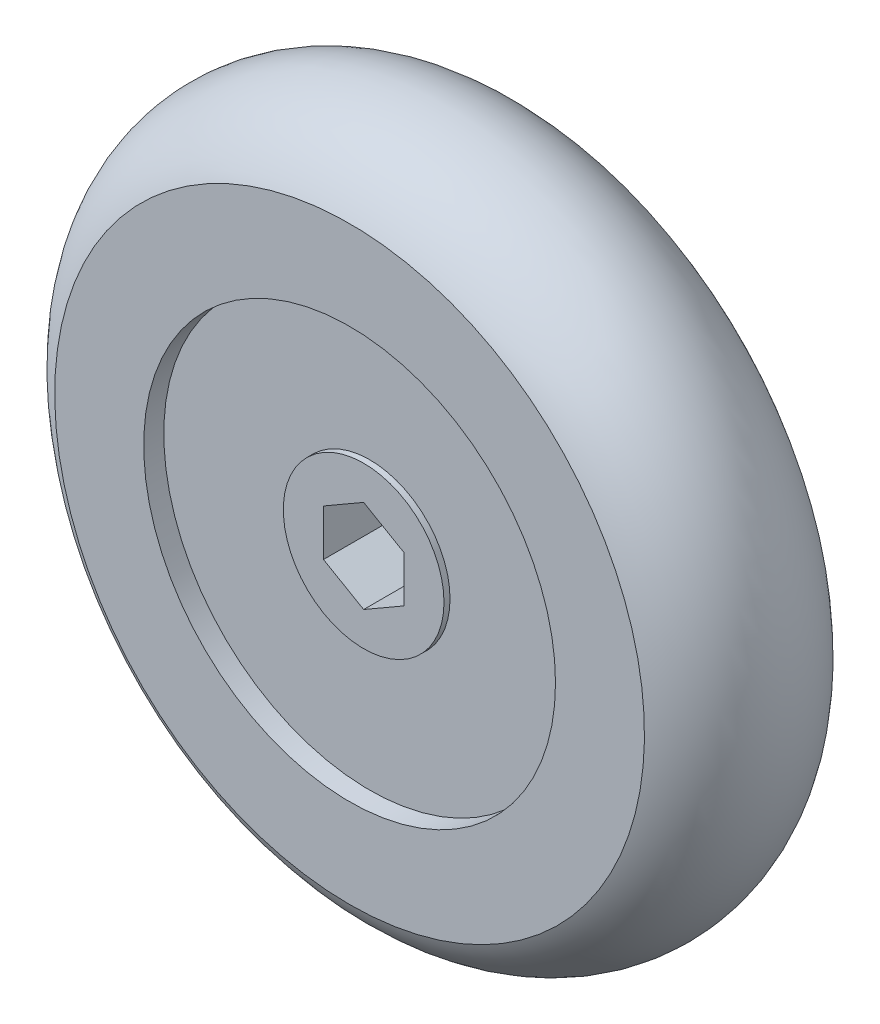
ISO-10303-21;
HEADER;
FILE_DESCRIPTION(('STEP AP214'),'2;1');
FILE_NAME('part.step','',(''),(''),'','','');
FILE_SCHEMA(('AUTOMOTIVE_DESIGN { 1 0 10303 214 1 1 1 1 }'));
ENDSEC;
DATA;
#1=APPLICATION_CONTEXT('core data for automotive mechanical design processes');
#2=APPLICATION_PROTOCOL_DEFINITION('international standard','automotive_design',2000,#1);
#3=PRODUCT_CONTEXT('',#1,'mechanical');
#4=PRODUCT('Part','Part','',(#3));
#5=PRODUCT_RELATED_PRODUCT_CATEGORY('part','',(#4));
#6=PRODUCT_DEFINITION_FORMATION('','',#4);
#7=PRODUCT_DEFINITION_CONTEXT('part definition',#1,'design');
#8=PRODUCT_DEFINITION('design','',#6,#7);
#9=PRODUCT_DEFINITION_SHAPE('','',#8);
#10=(LENGTH_UNIT() NAMED_UNIT(*) SI_UNIT(.MILLI.,.METRE.));
#11=(NAMED_UNIT(*) PLANE_ANGLE_UNIT() SI_UNIT($,.RADIAN.));
#12=(NAMED_UNIT(*) SI_UNIT($,.STERADIAN.) SOLID_ANGLE_UNIT());
#13=UNCERTAINTY_MEASURE_WITH_UNIT(LENGTH_MEASURE(1.E-05),#10,'distance_accuracy_value','');
#14=(GEOMETRIC_REPRESENTATION_CONTEXT(3) GLOBAL_UNCERTAINTY_ASSIGNED_CONTEXT((#13)) GLOBAL_UNIT_ASSIGNED_CONTEXT((#10,
#11,#12)) REPRESENTATION_CONTEXT('',''));
#15=CARTESIAN_POINT('',(0.,0.,0.));
#16=DIRECTION('',(0.,0.,1.));
#17=DIRECTION('',(1.,0.,0.));
#18=AXIS2_PLACEMENT_3D('',#15,#16,#17);
#19=CARTESIAN_POINT('',(0.,14.679449,9.5));
#20=DIRECTION('',(0.,0.,1.));
#21=DIRECTION('',(1.,0.,0.));
#22=AXIS2_PLACEMENT_3D('',#19,#20,#21);
#23=PLANE('',#22);
#24=CARTESIAN_POINT('',(0.,0.,9.5));
#25=DIRECTION('',(0.,0.,1.));
#26=DIRECTION('',(0.,-1.,0.));
#27=AXIS2_PLACEMENT_3D('',#24,#25,#26);
#28=CIRCLE('',#27,14.6794494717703);
#29=CARTESIAN_POINT('',(0.,-14.6794494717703,9.50000000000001));
#30=VERTEX_POINT('',#29);
#31=EDGE_CURVE('E231',#30,#30,#28,.T.);
#32=ORIENTED_EDGE('',*,*,#31,.T.);
#33=EDGE_LOOP('',(#32));
#34=FACE_BOUND('',#33,.T.);
#35=CARTESIAN_POINT('',(0.,0.,9.5));
#36=DIRECTION('',(0.,0.,1.));
#37=DIRECTION('',(1.,0.,0.));
#38=AXIS2_PLACEMENT_3D('',#35,#36,#37);
#39=CIRCLE('',#38,10.25);
#40=CARTESIAN_POINT('',(10.25,0.,9.5));
#41=VERTEX_POINT('',#40);
#42=EDGE_CURVE('E9',#41,#41,#39,.T.);
#43=ORIENTED_EDGE('',*,*,#42,.F.);
#44=EDGE_LOOP('',(#43));
#45=FACE_BOUND('',#44,.T.);
#46=ADVANCED_FACE('F14',(#34,#45),#23,.T.);
#47=CARTESIAN_POINT('',(0.,0.,12.5));
#48=DIRECTION('',(0.,0.,1.));
#49=DIRECTION('',(1.,0.,0.));
#50=AXIS2_PLACEMENT_3D('',#47,#48,#49);
#51=CYLINDRICAL_SURFACE('',#50,10.25);
#52=ORIENTED_EDGE('',*,*,#42,.T.);
#53=EDGE_LOOP('',(#52));
#54=FACE_BOUND('',#53,.T.);
#55=CARTESIAN_POINT('',(0.,0.,8.5));
#56=DIRECTION('',(0.,0.,1.));
#57=DIRECTION('',(1.,0.,0.));
#58=AXIS2_PLACEMENT_3D('',#55,#56,#57);
#59=CIRCLE('',#58,10.25);
#60=CARTESIAN_POINT('',(10.25,0.,8.5));
#61=VERTEX_POINT('',#60);
#62=EDGE_CURVE('E21',#61,#61,#59,.T.);
#63=ORIENTED_EDGE('',*,*,#62,.F.);
#64=EDGE_LOOP('',(#63));
#65=FACE_BOUND('',#64,.T.);
#66=ADVANCED_FACE('F119',(#54,#65),#51,.F.);
#67=CARTESIAN_POINT('',(0.,10.25,8.5));
#68=DIRECTION('',(0.,0.,1.));
#69=DIRECTION('',(1.,0.,0.));
#70=AXIS2_PLACEMENT_3D('',#67,#68,#69);
#71=PLANE('',#70);
#72=ORIENTED_EDGE('',*,*,#62,.T.);
#73=EDGE_LOOP('',(#72));
#74=FACE_BOUND('',#73,.T.);
#75=CARTESIAN_POINT('',(0.,0.,8.49999999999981));
#76=DIRECTION('',(0.,0.,1.));
#77=DIRECTION('',(1.,0.,0.));
#78=AXIS2_PLACEMENT_3D('',#75,#76,#77);
#79=CIRCLE('',#78,4.0000000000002);
#80=CARTESIAN_POINT('',(4.0000000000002,0.,8.49999999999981));
#81=VERTEX_POINT('',#80);
#82=EDGE_CURVE('E111',#81,#81,#79,.T.);
#83=ORIENTED_EDGE('',*,*,#82,.F.);
#84=EDGE_LOOP('',(#83));
#85=FACE_BOUND('',#84,.T.);
#86=ADVANCED_FACE('F116',(#74,#85),#71,.T.);
#87=CARTESIAN_POINT('',(0.,0.,12.5));
#88=DIRECTION('',(0.,0.,1.));
#89=DIRECTION('',(1.,0.,0.));
#90=AXIS2_PLACEMENT_3D('',#87,#88,#89);
#91=CYLINDRICAL_SURFACE('',#90,4.0000000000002);
#92=ORIENTED_EDGE('',*,*,#82,.T.);
#93=EDGE_LOOP('',(#92));
#94=FACE_BOUND('',#93,.T.);
#95=CARTESIAN_POINT('',(0.,0.,8.8));
#96=DIRECTION('',(0.,0.,1.));
#97=DIRECTION('',(1.,0.,0.));
#98=AXIS2_PLACEMENT_3D('',#95,#96,#97);
#99=CIRCLE('',#98,4.0000000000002);
#100=CARTESIAN_POINT('',(4.0000000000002,0.,8.8));
#101=VERTEX_POINT('',#100);
#102=EDGE_CURVE('E108',#101,#101,#99,.T.);
#103=ORIENTED_EDGE('',*,*,#102,.F.);
#104=EDGE_LOOP('',(#103));
#105=FACE_BOUND('',#104,.T.);
#106=ADVANCED_FACE('F127',(#94,#105),#91,.T.);
#107=CARTESIAN_POINT('',(0.,4.0000000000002,8.8));
#108=DIRECTION('',(0.,0.,1.));
#109=DIRECTION('',(1.,0.,0.));
#110=AXIS2_PLACEMENT_3D('',#107,#108,#109);
#111=PLANE('',#110);
#112=ORIENTED_EDGE('',*,*,#102,.T.);
#113=EDGE_LOOP('',(#112));
#114=FACE_BOUND('',#113,.T.);
#115=DIRECTION('',(0.866025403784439,-0.5,0.));
#116=VECTOR('',#115,1.);
#117=CARTESIAN_POINT('',(-2.,-1.15470053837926,8.8));
#118=LINE('',#117,#116);
#119=CARTESIAN_POINT('',(-2.,-1.15470053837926,8.8));
#120=VERTEX_POINT('',#119);
#121=CARTESIAN_POINT('',(0.,-2.30940107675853,8.8));
#122=VERTEX_POINT('',#121);
#123=EDGE_CURVE('E70',#120,#122,#118,.T.);
#124=ORIENTED_EDGE('',*,*,#123,.F.);
#125=DIRECTION('',(0.,-1.,0.));
#126=VECTOR('',#125,1.);
#127=CARTESIAN_POINT('',(-2.,1.15470053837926,8.8));
#128=LINE('',#127,#126);
#129=CARTESIAN_POINT('',(-2.,1.15470053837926,8.8));
#130=VERTEX_POINT('',#129);
#131=EDGE_CURVE('E64',#130,#120,#128,.T.);
#132=ORIENTED_EDGE('',*,*,#131,.F.);
#133=DIRECTION('',(-0.866025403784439,-0.5,0.));
#134=VECTOR('',#133,1.);
#135=CARTESIAN_POINT('',(0.,2.30940107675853,8.8));
#136=LINE('',#135,#134);
#137=CARTESIAN_POINT('',(0.,2.30940107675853,8.8));
#138=VERTEX_POINT('',#137);
#139=EDGE_CURVE('E67',#138,#130,#136,.T.);
#140=ORIENTED_EDGE('',*,*,#139,.F.);
#141=DIRECTION('',(-0.866025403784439,0.5,0.));
#142=VECTOR('',#141,1.);
#143=CARTESIAN_POINT('',(2.,1.15470053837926,8.8));
#144=LINE('',#143,#142);
#145=CARTESIAN_POINT('',(2.,1.15470053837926,8.8));
#146=VERTEX_POINT('',#145);
#147=EDGE_CURVE('E84',#146,#138,#144,.T.);
#148=ORIENTED_EDGE('',*,*,#147,.F.);
#149=DIRECTION('',(0.,1.,0.));
#150=VECTOR('',#149,1.);
#151=CARTESIAN_POINT('',(2.,-1.15470053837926,8.8));
#152=LINE('',#151,#150);
#153=CARTESIAN_POINT('',(2.,-1.15470053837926,8.8));
#154=VERTEX_POINT('',#153);
#155=EDGE_CURVE('E237',#154,#146,#152,.T.);
#156=ORIENTED_EDGE('',*,*,#155,.F.);
#157=DIRECTION('',(0.866025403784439,0.5,0.));
#158=VECTOR('',#157,1.);
#159=CARTESIAN_POINT('',(0.,-2.30940107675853,8.8));
#160=LINE('',#159,#158);
#161=EDGE_CURVE('E240',#122,#154,#160,.T.);
#162=ORIENTED_EDGE('',*,*,#161,.F.);
#163=EDGE_LOOP('',(#124,#132,#140,#148,#156,#162));
#164=FACE_BOUND('',#163,.T.);
#165=ADVANCED_FACE('F66',(#114,#164),#111,.T.);
#166=CARTESIAN_POINT('',(-2.,1.15470053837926,16.4376261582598));
#167=DIRECTION('',(1.,0.,0.));
#168=DIRECTION('',(0.,0.,-1.));
#169=AXIS2_PLACEMENT_3D('',#166,#167,#168);
#170=PLANE('',#169);
#171=DIRECTION('',(0.,0.,-1.));
#172=VECTOR('',#171,1.);
#173=CARTESIAN_POINT('',(-2.,1.15470053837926,16.4376261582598));
#174=LINE('',#173,#172);
#175=CARTESIAN_POINT('',(-2.,1.15470053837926,5.3));
#176=VERTEX_POINT('',#175);
#177=EDGE_CURVE('E80',#130,#176,#174,.T.);
#178=ORIENTED_EDGE('',*,*,#177,.F.);
#179=ORIENTED_EDGE('',*,*,#131,.T.);
#180=DIRECTION('',(0.,0.,-1.));
#181=VECTOR('',#180,1.);
#182=CARTESIAN_POINT('',(-2.,-1.15470053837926,16.4376261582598));
#183=LINE('',#182,#181);
#184=CARTESIAN_POINT('',(-2.,-1.15470053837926,5.3));
#185=VERTEX_POINT('',#184);
#186=EDGE_CURVE('E89',#120,#185,#183,.T.);
#187=ORIENTED_EDGE('',*,*,#186,.T.);
#188=DIRECTION('',(0.,-1.,0.));
#189=VECTOR('',#188,1.);
#190=CARTESIAN_POINT('',(-2.,1.15470053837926,5.3));
#191=LINE('',#190,#189);
#192=EDGE_CURVE('E88',#176,#185,#191,.T.);
#193=ORIENTED_EDGE('',*,*,#192,.F.);
#194=EDGE_LOOP('',(#178,#179,#187,#193));
#195=FACE_BOUND('',#194,.T.);
#196=ADVANCED_FACE('F87',(#195),#170,.T.);
#197=CARTESIAN_POINT('',(0.,2.30940107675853,16.4376261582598));
#198=DIRECTION('',(0.5,-0.866025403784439,0.));
#199=DIRECTION('',(0.866025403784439,0.5,0.));
#200=AXIS2_PLACEMENT_3D('',#197,#198,#199);
#201=PLANE('',#200);
#202=DIRECTION('',(0.,0.,-1.));
#203=VECTOR('',#202,1.);
#204=CARTESIAN_POINT('',(0.,2.30940107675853,16.4376261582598));
#205=LINE('',#204,#203);
#206=CARTESIAN_POINT('',(0.,2.30940107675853,5.3));
#207=VERTEX_POINT('',#206);
#208=EDGE_CURVE('E82',#138,#207,#205,.T.);
#209=ORIENTED_EDGE('',*,*,#208,.F.);
#210=ORIENTED_EDGE('',*,*,#139,.T.);
#211=ORIENTED_EDGE('',*,*,#177,.T.);
#212=DIRECTION('',(-0.866025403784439,-0.5,0.));
#213=VECTOR('',#212,1.);
#214=CARTESIAN_POINT('',(0.,2.30940107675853,5.3));
#215=LINE('',#214,#213);
#216=EDGE_CURVE('E28',#207,#176,#215,.T.);
#217=ORIENTED_EDGE('',*,*,#216,.F.);
#218=EDGE_LOOP('',(#209,#210,#211,#217));
#219=FACE_BOUND('',#218,.T.);
#220=ADVANCED_FACE('F79',(#219),#201,.T.);
#221=CARTESIAN_POINT('',(2.,1.15470053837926,16.4376261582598));
#222=DIRECTION('',(-0.5,-0.866025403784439,0.));
#223=DIRECTION('',(0.866025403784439,-0.5,0.));
#224=AXIS2_PLACEMENT_3D('',#221,#222,#223);
#225=PLANE('',#224);
#226=DIRECTION('',(0.,0.,-1.));
#227=VECTOR('',#226,1.);
#228=CARTESIAN_POINT('',(2.,1.15470053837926,16.4376261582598));
#229=LINE('',#228,#227);
#230=CARTESIAN_POINT('',(2.,1.15470053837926,5.3));
#231=VERTEX_POINT('',#230);
#232=EDGE_CURVE('E91',#146,#231,#229,.T.);
#233=ORIENTED_EDGE('',*,*,#232,.F.);
#234=ORIENTED_EDGE('',*,*,#147,.T.);
#235=ORIENTED_EDGE('',*,*,#208,.T.);
#236=DIRECTION('',(-0.866025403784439,0.5,0.));
#237=VECTOR('',#236,1.);
#238=CARTESIAN_POINT('',(2.,1.15470053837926,5.3));
#239=LINE('',#238,#237);
#240=EDGE_CURVE('E33',#231,#207,#239,.T.);
#241=ORIENTED_EDGE('',*,*,#240,.F.);
#242=EDGE_LOOP('',(#233,#234,#235,#241));
#243=FACE_BOUND('',#242,.T.);
#244=ADVANCED_FACE('F165',(#243),#225,.T.);
#245=CARTESIAN_POINT('',(2.,-1.15470053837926,16.4376261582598));
#246=DIRECTION('',(-1.,0.,0.));
#247=DIRECTION('',(0.,0.,1.));
#248=AXIS2_PLACEMENT_3D('',#245,#246,#247);
#249=PLANE('',#248);
#250=DIRECTION('',(0.,0.,-1.));
#251=VECTOR('',#250,1.);
#252=CARTESIAN_POINT('',(2.,-1.15470053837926,16.4376261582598));
#253=LINE('',#252,#251);
#254=CARTESIAN_POINT('',(2.,-1.15470053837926,5.3));
#255=VERTEX_POINT('',#254);
#256=EDGE_CURVE('E98',#154,#255,#253,.T.);
#257=ORIENTED_EDGE('',*,*,#256,.F.);
#258=ORIENTED_EDGE('',*,*,#155,.T.);
#259=ORIENTED_EDGE('',*,*,#232,.T.);
#260=DIRECTION('',(0.,1.,0.));
#261=VECTOR('',#260,1.);
#262=CARTESIAN_POINT('',(2.,-1.15470053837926,5.3));
#263=LINE('',#262,#261);
#264=EDGE_CURVE('E248',#255,#231,#263,.T.);
#265=ORIENTED_EDGE('',*,*,#264,.F.);
#266=EDGE_LOOP('',(#257,#258,#259,#265));
#267=FACE_BOUND('',#266,.T.);
#268=ADVANCED_FACE('F161',(#267),#249,.T.);
#269=CARTESIAN_POINT('',(0.,-2.30940107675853,16.4376261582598));
#270=DIRECTION('',(-0.5,0.866025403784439,0.));
#271=DIRECTION('',(-0.866025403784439,-0.5,0.));
#272=AXIS2_PLACEMENT_3D('',#269,#270,#271);
#273=PLANE('',#272);
#274=DIRECTION('',(0.,0.,-1.));
#275=VECTOR('',#274,1.);
#276=CARTESIAN_POINT('',(0.,-2.30940107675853,16.4376261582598));
#277=LINE('',#276,#275);
#278=CARTESIAN_POINT('',(0.,-2.30940107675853,5.3));
#279=VERTEX_POINT('',#278);
#280=EDGE_CURVE('E76',#122,#279,#277,.T.);
#281=ORIENTED_EDGE('',*,*,#280,.F.);
#282=ORIENTED_EDGE('',*,*,#161,.T.);
#283=ORIENTED_EDGE('',*,*,#256,.T.);
#284=DIRECTION('',(0.866025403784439,0.5,0.));
#285=VECTOR('',#284,1.);
#286=CARTESIAN_POINT('',(0.,-2.30940107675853,5.3));
#287=LINE('',#286,#285);
#288=EDGE_CURVE('E246',#279,#255,#287,.T.);
#289=ORIENTED_EDGE('',*,*,#288,.F.);
#290=EDGE_LOOP('',(#281,#282,#283,#289));
#291=FACE_BOUND('',#290,.T.);
#292=ADVANCED_FACE('F157',(#291),#273,.T.);
#293=CARTESIAN_POINT('',(-2.,-1.15470053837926,16.4376261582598));
#294=DIRECTION('',(0.5,0.866025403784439,0.));
#295=DIRECTION('',(-0.866025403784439,0.5,0.));
#296=AXIS2_PLACEMENT_3D('',#293,#294,#295);
#297=PLANE('',#296);
#298=ORIENTED_EDGE('',*,*,#186,.F.);
#299=ORIENTED_EDGE('',*,*,#123,.T.);
#300=ORIENTED_EDGE('',*,*,#280,.T.);
#301=DIRECTION('',(0.866025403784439,-0.5,0.));
#302=VECTOR('',#301,1.);
#303=CARTESIAN_POINT('',(-2.,-1.15470053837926,5.3));
#304=LINE('',#303,#302);
#305=EDGE_CURVE('E244',#185,#279,#304,.T.);
#306=ORIENTED_EDGE('',*,*,#305,.F.);
#307=EDGE_LOOP('',(#298,#299,#300,#306));
#308=FACE_BOUND('',#307,.T.);
#309=ADVANCED_FACE('F154',(#308),#297,.T.);
#310=CARTESIAN_POINT('',(0.,0.,5.3));
#311=DIRECTION('',(0.,0.,1.));
#312=DIRECTION('',(1.,0.,0.));
#313=AXIS2_PLACEMENT_3D('',#310,#311,#312);
#314=PLANE('',#313);
#315=ORIENTED_EDGE('',*,*,#192,.T.);
#316=ORIENTED_EDGE('',*,*,#305,.T.);
#317=ORIENTED_EDGE('',*,*,#288,.T.);
#318=ORIENTED_EDGE('',*,*,#264,.T.);
#319=ORIENTED_EDGE('',*,*,#240,.T.);
#320=ORIENTED_EDGE('',*,*,#216,.T.);
#321=EDGE_LOOP('',(#315,#316,#317,#318,#319,#320));
#322=FACE_BOUND('',#321,.T.);
#323=ADVANCED_FACE('F151',(#322),#314,.T.);
#324=CARTESIAN_POINT('',(0.,0.,5.));
#325=DIRECTION('',(0.,0.,1.));
#326=DIRECTION('',(0.,-1.,0.));
#327=AXIS2_PLACEMENT_3D('',#324,#325,#326);
#328=TOROIDAL_SURFACE('',#327,12.5,5.);
#329=ORIENTED_EDGE('',*,*,#31,.F.);
#330=EDGE_LOOP('',(#329));
#331=FACE_BOUND('',#330,.T.);
#332=CARTESIAN_POINT('',(0.,0.,0.500000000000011));
#333=DIRECTION('',(0.,0.,1.));
#334=DIRECTION('',(0.,-1.,0.));
#335=AXIS2_PLACEMENT_3D('',#332,#333,#334);
#336=CIRCLE('',#335,14.6794494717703);
#337=CARTESIAN_POINT('',(0.,-14.6794494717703,0.500000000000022));
#338=VERTEX_POINT('',#337);
#339=EDGE_CURVE('E85',#338,#338,#336,.T.);
#340=ORIENTED_EDGE('',*,*,#339,.T.);
#341=EDGE_LOOP('',(#340));
#342=FACE_BOUND('',#341,.T.);
#343=ADVANCED_FACE('F141',(#331,#342),#328,.T.);
#344=CARTESIAN_POINT('',(0.,5.1,1.5));
#345=DIRECTION('',(0.,0.,-1.));
#346=DIRECTION('',(-1.,0.,0.));
#347=AXIS2_PLACEMENT_3D('',#344,#345,#346);
#348=PLANE('',#347);
#349=CARTESIAN_POINT('',(0.,0.,1.5));
#350=DIRECTION('',(0.,0.,1.));
#351=DIRECTION('',(1.,0.,0.));
#352=AXIS2_PLACEMENT_3D('',#349,#350,#351);
#353=CIRCLE('',#352,10.25);
#354=CARTESIAN_POINT('',(10.25,0.,1.5));
#355=VERTEX_POINT('',#354);
#356=EDGE_CURVE('E105',#355,#355,#353,.T.);
#357=ORIENTED_EDGE('',*,*,#356,.F.);
#358=EDGE_LOOP('',(#357));
#359=FACE_BOUND('',#358,.T.);
#360=CARTESIAN_POINT('',(0.,0.,1.5));
#361=DIRECTION('',(0.,0.,-1.));
#362=DIRECTION('',(-1.,0.,0.));
#363=AXIS2_PLACEMENT_3D('',#360,#361,#362);
#364=CIRCLE('',#363,5.);
#365=CARTESIAN_POINT('',(-5.,0.,1.5));
#366=VERTEX_POINT('',#365);
#367=EDGE_CURVE('E208',#366,#366,#364,.F.);
#368=ORIENTED_EDGE('',*,*,#367,.T.);
#369=EDGE_LOOP('',(#368));
#370=FACE_BOUND('',#369,.T.);
#371=ADVANCED_FACE('F137',(#359,#370),#348,.T.);
#372=CARTESIAN_POINT('',(0.,0.,12.5));
#373=DIRECTION('',(0.,0.,1.));
#374=DIRECTION('',(1.,0.,0.));
#375=AXIS2_PLACEMENT_3D('',#372,#373,#374);
#376=CYLINDRICAL_SURFACE('',#375,10.25);
#377=ORIENTED_EDGE('',*,*,#356,.T.);
#378=EDGE_LOOP('',(#377));
#379=FACE_BOUND('',#378,.T.);
#380=CARTESIAN_POINT('',(0.,0.,0.5));
#381=DIRECTION('',(0.,0.,1.));
#382=DIRECTION('',(1.,0.,0.));
#383=AXIS2_PLACEMENT_3D('',#380,#381,#382);
#384=CIRCLE('',#383,10.25);
#385=CARTESIAN_POINT('',(10.25,0.,0.5));
#386=VERTEX_POINT('',#385);
#387=EDGE_CURVE('E75',#386,#386,#384,.T.);
#388=ORIENTED_EDGE('',*,*,#387,.F.);
#389=EDGE_LOOP('',(#388));
#390=FACE_BOUND('',#389,.T.);
#391=ADVANCED_FACE('F140',(#379,#390),#376,.F.);
#392=CARTESIAN_POINT('',(0.,14.679449,0.5));
#393=DIRECTION('',(0.,0.,-1.));
#394=DIRECTION('',(-1.,0.,0.));
#395=AXIS2_PLACEMENT_3D('',#392,#393,#394);
#396=PLANE('',#395);
#397=ORIENTED_EDGE('',*,*,#387,.T.);
#398=EDGE_LOOP('',(#397));
#399=FACE_BOUND('',#398,.T.);
#400=ORIENTED_EDGE('',*,*,#339,.F.);
#401=EDGE_LOOP('',(#400));
#402=FACE_BOUND('',#401,.T.);
#403=ADVANCED_FACE('F145',(#399,#402),#396,.T.);
#404=CARTESIAN_POINT('',(0.,0.,15.9249783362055));
#405=DIRECTION('',(0.,0.,-1.));
#406=DIRECTION('',(-1.,0.,0.));
#407=AXIS2_PLACEMENT_3D('',#404,#405,#406);
#408=CYLINDRICAL_SURFACE('',#407,5.);
#409=ORIENTED_EDGE('',*,*,#367,.F.);
#410=EDGE_LOOP('',(#409));
#411=FACE_BOUND('',#410,.T.);
#412=CARTESIAN_POINT('',(0.,0.,0.));
#413=DIRECTION('',(0.,0.,-1.));
#414=DIRECTION('',(-1.,0.,0.));
#415=AXIS2_PLACEMENT_3D('',#412,#413,#414);
#416=CIRCLE('',#415,5.);
#417=CARTESIAN_POINT('',(-5.,0.,0.));
#418=VERTEX_POINT('',#417);
#419=EDGE_CURVE('E211',#418,#418,#416,.T.);
#420=ORIENTED_EDGE('',*,*,#419,.F.);
#421=EDGE_LOOP('',(#420));
#422=FACE_BOUND('',#421,.T.);
#423=ADVANCED_FACE('F149',(#411,#422),#408,.T.);
#424=CARTESIAN_POINT('',(0.,0.,-8.));
#425=DIRECTION('',(0.,0.,-1.));
#426=DIRECTION('',(-1.,0.,0.));
#427=AXIS2_PLACEMENT_3D('',#424,#425,#426);
#428=PLANE('',#427);
#429=CARTESIAN_POINT('',(0.,0.,-8.));
#430=DIRECTION('',(0.,0.,-1.));
#431=DIRECTION('',(0.,1.,0.));
#432=AXIS2_PLACEMENT_3D('',#429,#430,#431);
#433=CIRCLE('',#432,2.1);
#434=CARTESIAN_POINT('',(0.,2.09999999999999,-8.));
#435=VERTEX_POINT('',#434);
#436=EDGE_CURVE('E214',#435,#435,#433,.T.);
#437=ORIENTED_EDGE('',*,*,#436,.T.);
#438=EDGE_LOOP('',(#437));
#439=FACE_BOUND('',#438,.T.);
#440=ADVANCED_FACE('F179',(#439),#428,.T.);
#441=CARTESIAN_POINT('',(0.,0.,-7.6));
#442=DIRECTION('',(0.,0.,1.));
#443=DIRECTION('',(0.,-1.,0.));
#444=AXIS2_PLACEMENT_3D('',#441,#442,#443);
#445=CONICAL_SURFACE('',#444,2.5,0.785398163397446);
#446=ORIENTED_EDGE('',*,*,#436,.F.);
#447=EDGE_LOOP('',(#446));
#448=FACE_BOUND('',#447,.T.);
#449=CARTESIAN_POINT('',(0.,0.,-7.6));
#450=DIRECTION('',(0.,0.,-1.));
#451=DIRECTION('',(0.,1.,0.));
#452=AXIS2_PLACEMENT_3D('',#449,#450,#451);
#453=CIRCLE('',#452,2.5);
#454=CARTESIAN_POINT('',(0.,2.49999999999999,-7.6));
#455=VERTEX_POINT('',#454);
#456=EDGE_CURVE('E219',#455,#455,#453,.T.);
#457=ORIENTED_EDGE('',*,*,#456,.T.);
#458=EDGE_LOOP('',(#457));
#459=FACE_BOUND('',#458,.T.);
#460=ADVANCED_FACE('F182',(#448,#459),#445,.T.);
#461=CARTESIAN_POINT('',(0.,0.,-5.0618089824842));
#462=DIRECTION('',(0.,0.,-1.));
#463=DIRECTION('',(0.,1.,0.));
#464=AXIS2_PLACEMENT_3D('',#461,#462,#463);
#465=CYLINDRICAL_SURFACE('',#464,2.5);
#466=ORIENTED_EDGE('',*,*,#456,.F.);
#467=EDGE_LOOP('',(#466));
#468=FACE_BOUND('',#467,.T.);
#469=CARTESIAN_POINT('',(0.,0.,-1.6));
#470=DIRECTION('',(0.,0.,-1.));
#471=DIRECTION('',(0.,1.,0.));
#472=AXIS2_PLACEMENT_3D('',#469,#470,#471);
#473=CIRCLE('',#472,2.5);
#474=CARTESIAN_POINT('',(0.,2.49999999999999,-1.6));
#475=VERTEX_POINT('',#474);
#476=EDGE_CURVE('E222',#475,#475,#473,.T.);
#477=ORIENTED_EDGE('',*,*,#476,.T.);
#478=EDGE_LOOP('',(#477));
#479=FACE_BOUND('',#478,.T.);
#480=ADVANCED_FACE('F193',(#468,#479),#465,.T.);
#481=CARTESIAN_POINT('',(0.,2.,-1.6));
#482=DIRECTION('',(0.,0.,-1.));
#483=DIRECTION('',(0.,1.,0.));
#484=AXIS2_PLACEMENT_3D('',#481,#482,#483);
#485=PLANE('',#484);
#486=ORIENTED_EDGE('',*,*,#476,.F.);
#487=EDGE_LOOP('',(#486));
#488=FACE_BOUND('',#487,.T.);
#489=CARTESIAN_POINT('',(0.,0.,-1.6));
#490=DIRECTION('',(0.,0.,-1.));
#491=DIRECTION('',(0.,1.,0.));
#492=AXIS2_PLACEMENT_3D('',#489,#490,#491);
#493=CIRCLE('',#492,2.);
#494=CARTESIAN_POINT('',(0.,1.99999999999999,-1.6));
#495=VERTEX_POINT('',#494);
#496=EDGE_CURVE('E225',#495,#495,#493,.T.);
#497=ORIENTED_EDGE('',*,*,#496,.T.);
#498=EDGE_LOOP('',(#497));
#499=FACE_BOUND('',#498,.T.);
#500=ADVANCED_FACE('F189',(#488,#499),#485,.F.);
#501=CARTESIAN_POINT('',(0.,0.,-5.0618089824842));
#502=DIRECTION('',(0.,0.,-1.));
#503=DIRECTION('',(0.,1.,0.));
#504=AXIS2_PLACEMENT_3D('',#501,#502,#503);
#505=CYLINDRICAL_SURFACE('',#504,2.);
#506=ORIENTED_EDGE('',*,*,#496,.F.);
#507=EDGE_LOOP('',(#506));
#508=FACE_BOUND('',#507,.T.);
#509=CARTESIAN_POINT('',(0.,0.,0.));
#510=DIRECTION('',(0.,0.,-1.));
#511=DIRECTION('',(0.,1.,0.));
#512=AXIS2_PLACEMENT_3D('',#509,#510,#511);
#513=CIRCLE('',#512,2.);
#514=CARTESIAN_POINT('',(0.,2.,0.));
#515=VERTEX_POINT('',#514);
#516=EDGE_CURVE('E228',#515,#515,#513,.T.);
#517=ORIENTED_EDGE('',*,*,#516,.T.);
#518=EDGE_LOOP('',(#517));
#519=FACE_BOUND('',#518,.T.);
#520=ADVANCED_FACE('F177',(#508,#519),#505,.T.);
#521=CARTESIAN_POINT('',(0.,0.,0.));
#522=DIRECTION('',(0.,0.,-1.));
#523=DIRECTION('',(-1.,0.,0.));
#524=AXIS2_PLACEMENT_3D('',#521,#522,#523);
#525=PLANE('',#524);
#526=ORIENTED_EDGE('',*,*,#516,.F.);
#527=EDGE_LOOP('',(#526));
#528=FACE_BOUND('',#527,.T.);
#529=ORIENTED_EDGE('',*,*,#419,.T.);
#530=EDGE_LOOP('',(#529));
#531=FACE_BOUND('',#530,.T.);
#532=ADVANCED_FACE('F174',(#528,#531),#525,.T.);
#533=CLOSED_SHELL('',(#46,#66,#86,#106,#165,#196,#220,#244,#268,#292,#309,#323,#343,#371,#391,
#403,#423,#440,#460,#480,#500,#520,#532));
#534=MANIFOLD_SOLID_BREP('B1',#533);
#535=ADVANCED_BREP_SHAPE_REPRESENTATION('',(#18,#534),#14);
#536=SHAPE_DEFINITION_REPRESENTATION(#9,#535);
ENDSEC;
END-ISO-10303-21;
